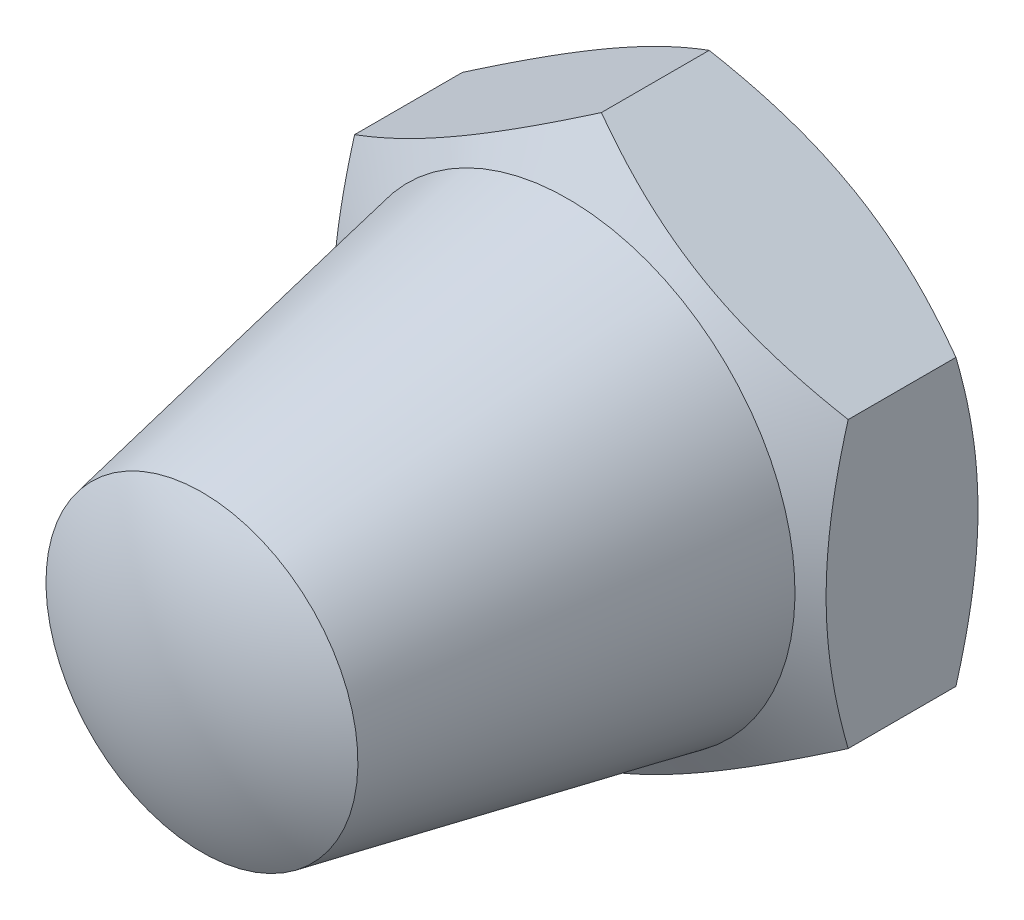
ISO-10303-21;
HEADER;
FILE_DESCRIPTION(('STEP AP214'),'2;1');
FILE_NAME('part.step','',(''),(''),'','','');
FILE_SCHEMA(('AUTOMOTIVE_DESIGN { 1 0 10303 214 1 1 1 1 }'));
ENDSEC;
DATA;
#1=APPLICATION_CONTEXT('core data for automotive mechanical design processes');
#2=APPLICATION_PROTOCOL_DEFINITION('international standard','automotive_design',2000,#1);
#3=PRODUCT_CONTEXT('',#1,'mechanical');
#4=PRODUCT('Part','Part','',(#3));
#5=PRODUCT_RELATED_PRODUCT_CATEGORY('part','',(#4));
#6=PRODUCT_DEFINITION_FORMATION('','',#4);
#7=PRODUCT_DEFINITION_CONTEXT('part definition',#1,'design');
#8=PRODUCT_DEFINITION('design','',#6,#7);
#9=PRODUCT_DEFINITION_SHAPE('','',#8);
#10=(LENGTH_UNIT() NAMED_UNIT(*) SI_UNIT(.MILLI.,.METRE.));
#11=(NAMED_UNIT(*) PLANE_ANGLE_UNIT() SI_UNIT($,.RADIAN.));
#12=(NAMED_UNIT(*) SI_UNIT($,.STERADIAN.) SOLID_ANGLE_UNIT());
#13=UNCERTAINTY_MEASURE_WITH_UNIT(LENGTH_MEASURE(1.E-05),#10,'distance_accuracy_value','');
#14=(GEOMETRIC_REPRESENTATION_CONTEXT(3) GLOBAL_UNCERTAINTY_ASSIGNED_CONTEXT((#13)) GLOBAL_UNIT_ASSIGNED_CONTEXT((#10,
#11,#12)) REPRESENTATION_CONTEXT('',''));
#15=CARTESIAN_POINT('',(0.,0.,0.));
#16=DIRECTION('',(0.,0.,1.));
#17=DIRECTION('',(1.,0.,0.));
#18=AXIS2_PLACEMENT_3D('',#15,#16,#17);
#19=CARTESIAN_POINT('',(0.,0.,0.));
#20=DIRECTION('',(0.,0.,1.));
#21=DIRECTION('',(-0.866025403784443,0.499999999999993,0.));
#22=AXIS2_PLACEMENT_3D('',#19,#20,#21);
#23=CONICAL_SURFACE('',#22,6.5,1.0471975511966);
#24=CARTESIAN_POINT('',(-6.5,-3.75300768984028,0.580623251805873));
#25=CARTESIAN_POINT('',(-6.5,-3.58802701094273,0.533004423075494));
#26=CARTESIAN_POINT('',(-6.5,-3.42243120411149,0.487546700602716));
#27=CARTESIAN_POINT('',(-6.5,-3.08989477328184,0.401548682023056));
#28=CARTESIAN_POINT('',(-6.5,-2.92295360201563,0.361010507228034));
#29=CARTESIAN_POINT('',(-6.5,-2.41945714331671,0.247571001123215));
#30=CARTESIAN_POINT('',(-6.5,-2.08091438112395,0.183047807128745));
#31=CARTESIAN_POINT('',(-6.5,-1.57429129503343,0.107386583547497));
#32=CARTESIAN_POINT('',(-6.5,-1.40772471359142,0.0858328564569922));
#33=CARTESIAN_POINT('',(-6.5,-1.0738389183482,0.0496903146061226));
#34=CARTESIAN_POINT('',(-6.5,-0.90651977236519,0.0351008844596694));
#35=CARTESIAN_POINT('',(-6.5,-0.571590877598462,0.0132587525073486));
#36=CARTESIAN_POINT('',(-6.5,-0.403981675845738,0.00599772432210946));
#37=CARTESIAN_POINT('',(-6.5,-0.0686176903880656,-0.00103969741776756));
#38=CARTESIAN_POINT('',(-6.5,0.0991370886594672,-0.000816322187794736));
#39=CARTESIAN_POINT('',(-6.5,0.558731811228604,0.0100834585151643));
#40=CARTESIAN_POINT('',(-6.5,0.850421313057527,0.0283818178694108));
#41=CARTESIAN_POINT('',(-6.5,1.43186293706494,0.0864063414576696));
#42=CARTESIAN_POINT('',(-6.5,1.72161301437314,0.126152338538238));
#43=CARTESIAN_POINT('',(-6.5,2.30422480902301,0.225505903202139));
#44=CARTESIAN_POINT('',(-6.5,2.59701301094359,0.285534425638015));
#45=CARTESIAN_POINT('',(-6.5,3.17822309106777,0.421774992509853));
#46=CARTESIAN_POINT('',(-6.5,3.46665241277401,0.497955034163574));
#47=CARTESIAN_POINT('',(-6.5,3.75300768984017,0.580623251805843));
#48=B_SPLINE_CURVE_WITH_KNOTS('',3,(#24,#25,#26,#27,#28,#29,#30,#31,#32,#33,#34,#35,#36,#37,#38,
#39,#40,#41,#42,#43,#44,#45,#46,#47),.UNSPECIFIED.,.F.,.F.,(4,2,2,2,2,2,2,2,2,2,2,4),(0.,
0.515105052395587,1.03043143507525,2.06322554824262,2.56697389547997,3.07067772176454,
3.57380860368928,4.0769239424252,4.9527935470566,5.82947446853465,6.72559912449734,
7.61996451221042),.UNSPECIFIED.);
#49=CARTESIAN_POINT('',(-6.5,0.,0.));
#50=VERTEX_POINT('',#49);
#51=CARTESIAN_POINT('',(-6.5,3.7527767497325,0.580556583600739));
#52=VERTEX_POINT('',#51);
#53=EDGE_CURVE('E144',#50,#52,#48,.T.);
#54=ORIENTED_EDGE('',*,*,#53,.T.);
#55=CARTESIAN_POINT('',(-6.5002,3.75266127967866,0.580623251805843));
#56=CARTESIAN_POINT('',(-6.35732254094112,3.83515161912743,0.533004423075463));
#57=CARTESIAN_POINT('',(-6.21391236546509,3.91794952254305,0.487546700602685));
#58=CARTESIAN_POINT('',(-5.92592736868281,4.08421773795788,0.401548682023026));
#59=CARTESIAN_POINT('',(-5.78135207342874,4.16768832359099,0.361010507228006));
#60=CARTESIAN_POINT('',(-5.34531134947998,4.41943655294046,0.247571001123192));
#61=CARTESIAN_POINT('',(-5.05212471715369,4.58870793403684,0.183047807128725));
#62=CARTESIAN_POINT('',(-4.61337625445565,4.8420194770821,0.10738658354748));
#63=CARTESIAN_POINT('',(-4.46912536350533,4.92530276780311,0.0858328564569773));
#64=CARTESIAN_POINT('',(-4.17997178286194,5.09224566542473,0.0496903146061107));
#65=CARTESIAN_POINT('',(-4.03506915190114,5.17590523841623,0.0351008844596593));
#66=CARTESIAN_POINT('',(-3.74501222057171,5.3433696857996,0.013258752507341));
#67=CARTESIAN_POINT('',(-3.59985839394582,5.42717428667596,0.00599772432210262));
#68=CARTESIAN_POINT('',(-3.30942466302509,5.59485627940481,-0.00103969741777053));
#69=CARTESIAN_POINT('',(-3.16414476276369,5.67873366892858,-0.000816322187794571));
#70=CARTESIAN_POINT('',(-2.76612405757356,5.90853103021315,0.0100834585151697));
#71=CARTESIAN_POINT('',(-2.51351353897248,6.05437578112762,0.028381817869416));
#72=CARTESIAN_POINT('',(-2.00997032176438,6.34509659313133,0.0864063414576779));
#73=CARTESIAN_POINT('',(-1.75903939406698,6.48997163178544,0.126152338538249));
#74=CARTESIAN_POINT('',(-1.25448277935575,6.78127752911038,0.225505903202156));
#75=CARTESIAN_POINT('',(-1.00092075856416,6.92767163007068,0.285534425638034));
#76=CARTESIAN_POINT('',(-0.497578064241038,7.21827667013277,0.421774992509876));
#77=CARTESIAN_POINT('',(-0.247790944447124,7.3624913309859,0.4979550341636));
#78=CARTESIAN_POINT('',(0.00019999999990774,7.50566896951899,0.580623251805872));
#79=B_SPLINE_CURVE_WITH_KNOTS('',3,(#55,#56,#57,#58,#59,#60,#61,#62,#63,#64,#65,#66,#67,#68,#69,
#70,#71,#72,#73,#74,#75,#76,#77,#78),.UNSPECIFIED.,.F.,.F.,(4,2,2,2,2,2,2,2,2,2,2,4),(0.,
0.515105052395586,1.03043143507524,2.06322554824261,2.56697389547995,3.07067772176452,
3.57380860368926,4.07692394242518,4.95279354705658,5.82947446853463,6.72559912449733,
7.61996451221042),.UNSPECIFIED.);
#80=CARTESIAN_POINT('',(-3.25000000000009,5.6291651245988,0.));
#81=VERTEX_POINT('',#80);
#82=EDGE_CURVE('E96',#52,#81,#79,.T.);
#83=ORIENTED_EDGE('',*,*,#82,.T.);
#84=CARTESIAN_POINT('',(0.,0.,0.));
#85=DIRECTION('',(0.,0.,-1.));
#86=DIRECTION('',(0.866025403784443,-0.499999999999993,0.));
#87=AXIS2_PLACEMENT_3D('',#84,#85,#86);
#88=CIRCLE('',#87,6.5);
#89=EDGE_CURVE('E271',#50,#81,#88,.T.);
#90=ORIENTED_EDGE('',*,*,#89,.F.);
#91=EDGE_LOOP('',(#54,#83,#90));
#92=FACE_BOUND('',#91,.T.);
#93=ADVANCED_FACE('F14',(#92),#23,.T.);
#94=CARTESIAN_POINT('',(3.24999999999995,5.62916512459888,0.));
#95=VERTEX_POINT('',#94);
#96=EDGE_CURVE('E272',#81,#95,#88,.T.);
#97=ORIENTED_EDGE('',*,*,#96,.F.);
#98=CARTESIAN_POINT('',(0.,7.50555349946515,0.580556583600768));
#99=VERTEX_POINT('',#98);
#100=EDGE_CURVE('E110',#81,#99,#79,.T.);
#101=ORIENTED_EDGE('',*,*,#100,.T.);
#102=CARTESIAN_POINT('',(-5.54115218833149,10.7047392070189,3.20652898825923));
#103=CARTESIAN_POINT('',(-5.29477516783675,10.5624933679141,3.06824212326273));
#104=CARTESIAN_POINT('',(-5.04783912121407,10.4199247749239,2.93126086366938));
#105=CARTESIAN_POINT('',(-4.55255194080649,10.1339705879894,2.66064242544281));
#106=CARTESIAN_POINT('',(-4.30420059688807,9.99058487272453,2.5270057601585));
#107=CARTESIAN_POINT('',(-3.80453528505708,9.70210297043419,2.26315208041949));
#108=CARTESIAN_POINT('',(-3.55321258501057,9.55700174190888,2.13295703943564));
#109=CARTESIAN_POINT('',(-3.04858964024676,9.26565754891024,1.8778010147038));
#110=CARTESIAN_POINT('',(-2.79528948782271,9.11941463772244,1.75283978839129));
#111=CARTESIAN_POINT('',(-2.27788742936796,8.82069241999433,1.50550497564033));
#112=CARTESIAN_POINT('',(-2.01370538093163,8.66816684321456,1.38335372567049));
#113=CARTESIAN_POINT('',(-1.48227292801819,8.36134417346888,1.14812603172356));
#114=CARTESIAN_POINT('',(-1.21502218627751,8.20704688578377,1.03505059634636));
#115=CARTESIAN_POINT('',(-0.677508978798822,7.89671349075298,0.820891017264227));
#116=CARTESIAN_POINT('',(-0.407253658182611,7.74068150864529,0.71978319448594));
#117=CARTESIAN_POINT('',(0.137136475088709,7.42637771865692,0.532757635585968));
#118=CARTESIAN_POINT('',(0.41127005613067,7.26810662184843,0.446835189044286));
#119=CARTESIAN_POINT('',(0.962017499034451,6.95013243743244,0.294716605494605));
#120=CARTESIAN_POINT('',(1.23860819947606,6.79044272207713,0.228410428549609));
#121=CARTESIAN_POINT('',(1.79533222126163,6.46901795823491,0.119232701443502));
#122=CARTESIAN_POINT('',(2.075465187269,6.30728311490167,0.0763588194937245));
#123=CARTESIAN_POINT('',(2.49534082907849,6.0648678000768,0.03246601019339));
#124=CARTESIAN_POINT('',(2.63431772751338,5.98462945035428,0.0212465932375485));
#125=CARTESIAN_POINT('',(2.91256414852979,5.82398380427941,0.00560203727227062));
#126=CARTESIAN_POINT('',(3.05183366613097,5.74357651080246,0.00117678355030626));
#127=CARTESIAN_POINT('',(3.33040824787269,5.58274140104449,-0.000766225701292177));
#128=CARTESIAN_POINT('',(3.46971331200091,5.50231358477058,0.00171601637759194));
#129=CARTESIAN_POINT('',(3.74810781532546,5.34158244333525,0.0135243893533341));
#130=CARTESIAN_POINT('',(3.8871972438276,5.26127912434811,0.0228508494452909));
#131=CARTESIAN_POINT('',(4.21963736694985,5.06934472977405,0.0531229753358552));
#132=CARTESIAN_POINT('',(4.41277894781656,4.95783438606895,0.0771985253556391));
#133=CARTESIAN_POINT('',(4.79765951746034,4.73562348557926,0.137250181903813));
#134=CARTESIAN_POINT('',(4.98939831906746,4.62492303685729,0.17322784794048));
#135=CARTESIAN_POINT('',(5.56227463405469,4.29417274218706,0.297109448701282));
#136=CARTESIAN_POINT('',(5.94086491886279,4.07559353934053,0.400940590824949));
#137=CARTESIAN_POINT('',(6.50702481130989,3.74872097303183,0.581447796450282));
#138=CARTESIAN_POINT('',(6.6975208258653,3.63873804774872,0.646593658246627));
#139=CARTESIAN_POINT('',(7.07666370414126,3.41983980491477,0.783766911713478));
#140=CARTESIAN_POINT('',(7.26531055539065,3.31092449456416,0.855794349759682));
#141=CARTESIAN_POINT('',(7.64081231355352,3.09412845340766,1.00556559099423));
#142=CARTESIAN_POINT('',(7.82766776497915,2.98624740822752,1.08330759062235));
#143=CARTESIAN_POINT('',(8.19982403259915,2.77138288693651,1.24358180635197));
#144=CARTESIAN_POINT('',(8.38512486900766,2.66439939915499,1.32611396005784));
#145=CARTESIAN_POINT('',(8.82994392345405,2.4075829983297,1.52979204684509));
#146=CARTESIAN_POINT('',(9.08878329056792,2.25814202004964,1.65291133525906));
#147=CARTESIAN_POINT('',(9.60418751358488,1.96057325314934,1.90536084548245));
#148=CARTESIAN_POINT('',(9.86075221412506,1.81244555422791,2.03469148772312));
#149=CARTESIAN_POINT('',(10.3720363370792,1.51725552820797,2.29828873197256));
#150=CARTESIAN_POINT('',(10.6267553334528,1.37019344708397,2.43255643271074));
#151=CARTESIAN_POINT('',(11.1346169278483,1.07697941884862,2.70501702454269));
#152=CARTESIAN_POINT('',(11.387759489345,0.930827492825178,2.84321000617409));
#153=CARTESIAN_POINT('',(11.8930170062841,0.639116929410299,3.12292631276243));
#154=CARTESIAN_POINT('',(12.1451304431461,0.493559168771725,3.26445328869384));
#155=CARTESIAN_POINT('',(12.6482508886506,0.203082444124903,3.55010805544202));
#156=CARTESIAN_POINT('',(12.8992578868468,0.0581634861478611,3.69423587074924));
#157=CARTESIAN_POINT('',(13.6508155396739,-0.375748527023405,4.12977253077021));
#158=CARTESIAN_POINT('',(14.1499773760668,-0.66393974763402,4.42437620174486));
#159=CARTESIAN_POINT('',(15.1023905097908,-1.21381572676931,4.99368726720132));
#160=CARTESIAN_POINT('',(15.5558642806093,-1.4756289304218,5.26790069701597));
#161=CARTESIAN_POINT('',(16.4611277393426,-1.99828303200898,5.82005580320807));
#162=CARTESIAN_POINT('',(16.9129173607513,-2.25912389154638,6.09799762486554));
#163=CARTESIAN_POINT('',(17.813986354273,-2.77935631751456,6.65596618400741));
#164=CARTESIAN_POINT('',(18.2632692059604,-3.03874989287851,6.93598544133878));
#165=CARTESIAN_POINT('',(19.1607624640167,-3.55691786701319,7.49823452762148));
#166=CARTESIAN_POINT('',(19.6089729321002,-3.81569230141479,7.78046422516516));
#167=CARTESIAN_POINT('',(20.0567911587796,-4.0742402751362,8.06351575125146));
#168=B_SPLINE_CURVE_WITH_KNOTS('',3,(#102,#103,#104,#105,#106,#107,#108,#109,#110,#111,#112,
#113,#114,#115,#116,#117,#118,#119,#120,#121,#122,#123,#124,#125,#126,#127,#128,#129,#130,#131,
#132,#133,#134,#135,#136,#137,#138,#139,#140,#141,#142,#143,#144,#145,#146,#147,#148,#149,#150,
#151,#152,#153,#154,#155,#156,#157,#158,#159,#160,#161,#162,#163,#164,#165,#166,#167),
.UNSPECIFIED.,.F.,.F.,(4,2,2,2,2,2,2,2,2,2,2,2,2,2,2,2,2,2,2,2,2,2,2,2,2,2,2,2,2,2,2,2,4),(0.,
0.948973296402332,1.89809136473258,2.85225848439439,3.80638133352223,4.79206603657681,
5.77786012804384,6.76166991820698,7.74517399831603,8.72305155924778,9.70083179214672,
10.1833150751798,10.6657902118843,11.1482651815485,11.6307633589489,12.3033341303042,
12.9759930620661,14.3220280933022,15.0101990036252,15.6983745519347,16.3863338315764,
17.0742841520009,18.043929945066,19.0136414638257,19.9835701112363,20.9535211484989,
21.9245888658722,22.8956657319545,24.8375327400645,26.6107620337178,28.3840606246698,
30.1526583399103,31.9211517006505),.UNSPECIFIED.);
#169=EDGE_CURVE('E182',#99,#95,#168,.T.);
#170=ORIENTED_EDGE('',*,*,#169,.T.);
#171=EDGE_LOOP('',(#97,#101,#170));
#172=FACE_BOUND('',#171,.T.);
#173=ADVANCED_FACE('F139',(#172),#23,.T.);
#174=CARTESIAN_POINT('',(6.5,0.,0.));
#175=VERTEX_POINT('',#174);
#176=EDGE_CURVE('E107',#95,#175,#88,.T.);
#177=ORIENTED_EDGE('',*,*,#176,.F.);
#178=CARTESIAN_POINT('',(6.5,3.7527767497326,0.580556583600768));
#179=VERTEX_POINT('',#178);
#180=EDGE_CURVE('E175',#95,#179,#168,.T.);
#181=ORIENTED_EDGE('',*,*,#180,.T.);
#182=CARTESIAN_POINT('',(6.5,3.75300768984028,0.580623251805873));
#183=CARTESIAN_POINT('',(6.5,3.58802701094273,0.533004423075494));
#184=CARTESIAN_POINT('',(6.5,3.42243120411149,0.487546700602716));
#185=CARTESIAN_POINT('',(6.5,3.08989477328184,0.401548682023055));
#186=CARTESIAN_POINT('',(6.5,2.92295360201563,0.361010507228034));
#187=CARTESIAN_POINT('',(6.5,2.41945714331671,0.247571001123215));
#188=CARTESIAN_POINT('',(6.5,2.08091438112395,0.183047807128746));
#189=CARTESIAN_POINT('',(6.5,1.57429129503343,0.107386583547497));
#190=CARTESIAN_POINT('',(6.5,1.40772471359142,0.085832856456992));
#191=CARTESIAN_POINT('',(6.5,1.0738389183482,0.0496903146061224));
#192=CARTESIAN_POINT('',(6.5,0.90651977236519,0.0351008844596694));
#193=CARTESIAN_POINT('',(6.5,0.571590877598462,0.0132587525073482));
#194=CARTESIAN_POINT('',(6.5,0.403981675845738,0.00599772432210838));
#195=CARTESIAN_POINT('',(6.5,0.0686176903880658,-0.00103969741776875));
#196=CARTESIAN_POINT('',(6.5,-0.0991370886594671,-0.000816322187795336));
#197=CARTESIAN_POINT('',(6.5,-0.558731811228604,0.0100834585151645));
#198=CARTESIAN_POINT('',(6.5,-0.850421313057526,0.0283818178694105));
#199=CARTESIAN_POINT('',(6.5,-1.43186293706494,0.086406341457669));
#200=CARTESIAN_POINT('',(6.5,-1.72161301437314,0.126152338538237));
#201=CARTESIAN_POINT('',(6.5,-2.30422480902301,0.225505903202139));
#202=CARTESIAN_POINT('',(6.5,-2.59701301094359,0.285534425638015));
#203=CARTESIAN_POINT('',(6.5,-3.17822309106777,0.421774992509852));
#204=CARTESIAN_POINT('',(6.5,-3.46665241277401,0.497955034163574));
#205=CARTESIAN_POINT('',(6.5,-3.75300768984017,0.580623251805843));
#206=B_SPLINE_CURVE_WITH_KNOTS('',3,(#182,#183,#184,#185,#186,#187,#188,#189,#190,#191,#192,
#193,#194,#195,#196,#197,#198,#199,#200,#201,#202,#203,#204,#205),.UNSPECIFIED.,.F.,.F.,(4,2,2,
2,2,2,2,2,2,2,2,4),(0.,0.515105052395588,1.03043143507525,2.06322554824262,2.56697389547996,
3.07067772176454,3.57380860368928,4.0769239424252,4.9527935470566,5.82947446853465,
6.72559912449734,7.61996451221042),.UNSPECIFIED.);
#207=EDGE_CURVE('E219',#179,#175,#206,.T.);
#208=ORIENTED_EDGE('',*,*,#207,.T.);
#209=EDGE_LOOP('',(#177,#181,#208));
#210=FACE_BOUND('',#209,.T.);
#211=ADVANCED_FACE('F278',(#210),#23,.T.);
#212=CARTESIAN_POINT('',(3.2500000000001,-5.6291651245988,0.));
#213=VERTEX_POINT('',#212);
#214=EDGE_CURVE('E104',#175,#213,#88,.T.);
#215=ORIENTED_EDGE('',*,*,#214,.F.);
#216=CARTESIAN_POINT('',(6.5,-3.7527767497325,0.580556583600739));
#217=VERTEX_POINT('',#216);
#218=EDGE_CURVE('E167',#175,#217,#206,.T.);
#219=ORIENTED_EDGE('',*,*,#218,.T.);
#220=CARTESIAN_POINT('',(6.5002,-3.75266127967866,0.580623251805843));
#221=CARTESIAN_POINT('',(6.35732254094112,-3.83515161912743,0.533004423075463));
#222=CARTESIAN_POINT('',(6.21391236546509,-3.91794952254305,0.487546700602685));
#223=CARTESIAN_POINT('',(5.92592736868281,-4.08421773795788,0.401548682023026));
#224=CARTESIAN_POINT('',(5.78135207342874,-4.16768832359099,0.361010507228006));
#225=CARTESIAN_POINT('',(5.34531134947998,-4.41943655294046,0.247571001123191));
#226=CARTESIAN_POINT('',(5.05212471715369,-4.58870793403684,0.183047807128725));
#227=CARTESIAN_POINT('',(4.61337625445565,-4.8420194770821,0.10738658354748));
#228=CARTESIAN_POINT('',(4.46912536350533,-4.92530276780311,0.0858328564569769));
#229=CARTESIAN_POINT('',(4.17997178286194,-5.09224566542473,0.0496903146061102));
#230=CARTESIAN_POINT('',(4.03506915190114,-5.17590523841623,0.0351008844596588));
#231=CARTESIAN_POINT('',(3.74501222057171,-5.3433696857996,0.0132587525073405));
#232=CARTESIAN_POINT('',(3.59985839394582,-5.42717428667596,0.00599772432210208));
#233=CARTESIAN_POINT('',(3.30942466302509,-5.59485627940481,-0.00103969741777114));
#234=CARTESIAN_POINT('',(3.16414476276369,-5.67873366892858,-0.000816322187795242));
#235=CARTESIAN_POINT('',(2.76612405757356,-5.90853103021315,0.0100834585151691));
#236=CARTESIAN_POINT('',(2.51351353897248,-6.05437578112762,0.0283818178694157));
#237=CARTESIAN_POINT('',(2.00997032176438,-6.34509659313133,0.0864063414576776));
#238=CARTESIAN_POINT('',(1.75903939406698,-6.48997163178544,0.126152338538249));
#239=CARTESIAN_POINT('',(1.25448277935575,-6.78127752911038,0.225505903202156));
#240=CARTESIAN_POINT('',(1.00092075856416,-6.92767163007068,0.285534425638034));
#241=CARTESIAN_POINT('',(0.497578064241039,-7.21827667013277,0.421774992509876));
#242=CARTESIAN_POINT('',(0.247790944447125,-7.3624913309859,0.4979550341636));
#243=CARTESIAN_POINT('',(-0.00019999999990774,-7.50566896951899,0.580623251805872));
#244=B_SPLINE_CURVE_WITH_KNOTS('',3,(#220,#221,#222,#223,#224,#225,#226,#227,#228,#229,#230,
#231,#232,#233,#234,#235,#236,#237,#238,#239,#240,#241,#242,#243),.UNSPECIFIED.,.F.,.F.,(4,2,2,
2,2,2,2,2,2,2,2,4),(0.,0.515105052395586,1.03043143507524,2.06322554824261,2.56697389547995,
3.07067772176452,3.57380860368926,4.07692394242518,4.95279354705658,5.82947446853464,
6.72559912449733,7.61996451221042),.UNSPECIFIED.);
#245=EDGE_CURVE('E217',#217,#213,#244,.T.);
#246=ORIENTED_EDGE('',*,*,#245,.T.);
#247=EDGE_LOOP('',(#215,#219,#246));
#248=FACE_BOUND('',#247,.T.);
#249=ADVANCED_FACE('F280',(#248),#23,.T.);
#250=CARTESIAN_POINT('',(-3.24999999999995,-5.62916512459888,0.));
#251=VERTEX_POINT('',#250);
#252=EDGE_CURVE('E109',#213,#251,#88,.T.);
#253=ORIENTED_EDGE('',*,*,#252,.F.);
#254=CARTESIAN_POINT('',(0.,-7.50555349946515,0.580556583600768));
#255=VERTEX_POINT('',#254);
#256=EDGE_CURVE('E159',#213,#255,#244,.T.);
#257=ORIENTED_EDGE('',*,*,#256,.T.);
#258=CARTESIAN_POINT('',(-12.0411521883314,-0.553591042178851,3.20652898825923));
#259=CARTESIAN_POINT('',(-11.7947751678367,-0.695836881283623,3.06824212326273));
#260=CARTESIAN_POINT('',(-11.547839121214,-0.838405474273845,2.93126086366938));
#261=CARTESIAN_POINT('',(-11.0525519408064,-1.12435966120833,2.66064242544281));
#262=CARTESIAN_POINT('',(-10.804200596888,-1.26774537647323,2.5270057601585));
#263=CARTESIAN_POINT('',(-10.304535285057,-1.55622727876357,2.26315208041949));
#264=CARTESIAN_POINT('',(-10.0532125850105,-1.70132850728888,2.13295703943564));
#265=CARTESIAN_POINT('',(-9.54858964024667,-1.99267270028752,1.8778010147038));
#266=CARTESIAN_POINT('',(-9.29528948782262,-2.13891561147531,1.75283978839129));
#267=CARTESIAN_POINT('',(-8.77788742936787,-2.43763782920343,1.50550497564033));
#268=CARTESIAN_POINT('',(-8.51370538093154,-2.5901634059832,1.38335372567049));
#269=CARTESIAN_POINT('',(-7.9822729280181,-2.89698607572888,1.14812603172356));
#270=CARTESIAN_POINT('',(-7.71502218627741,-3.05128336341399,1.03505059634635));
#271=CARTESIAN_POINT('',(-7.17750897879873,-3.36161675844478,0.820891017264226));
#272=CARTESIAN_POINT('',(-6.90725365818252,-3.51764874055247,0.719783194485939));
#273=CARTESIAN_POINT('',(-6.3628635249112,-3.83195253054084,0.532757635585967));
#274=CARTESIAN_POINT('',(-6.08872994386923,-3.99022362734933,0.446835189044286));
#275=CARTESIAN_POINT('',(-5.53798250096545,-4.30819781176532,0.294716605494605));
#276=CARTESIAN_POINT('',(-5.26139180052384,-4.46788752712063,0.228410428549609));
#277=CARTESIAN_POINT('',(-4.70466777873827,-4.78931229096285,0.119232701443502));
#278=CARTESIAN_POINT('',(-4.42453481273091,-4.95104713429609,0.0763588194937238));
#279=CARTESIAN_POINT('',(-4.00465917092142,-5.19346244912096,0.0324660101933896));
#280=CARTESIAN_POINT('',(-3.86568227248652,-5.27370079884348,0.0212465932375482));
#281=CARTESIAN_POINT('',(-3.58743585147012,-5.43434644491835,0.00560203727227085));
#282=CARTESIAN_POINT('',(-3.44816633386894,-5.5147537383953,0.0011767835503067));
#283=CARTESIAN_POINT('',(-3.16959175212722,-5.67558884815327,-0.000766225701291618));
#284=CARTESIAN_POINT('',(-3.030286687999,-5.75601666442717,0.0017160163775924));
#285=CARTESIAN_POINT('',(-2.75189218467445,-5.91674780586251,0.0135243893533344));
#286=CARTESIAN_POINT('',(-2.61280275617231,-5.99705112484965,0.0228508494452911));
#287=CARTESIAN_POINT('',(-2.28036263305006,-6.18898551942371,0.0531229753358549));
#288=CARTESIAN_POINT('',(-2.08722105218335,-6.30049586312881,0.0771985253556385));
#289=CARTESIAN_POINT('',(-1.70234048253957,-6.5227067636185,0.137250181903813));
#290=CARTESIAN_POINT('',(-1.51060168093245,-6.63340721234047,0.17322784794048));
#291=CARTESIAN_POINT('',(-0.937725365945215,-6.9641575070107,0.297109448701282));
#292=CARTESIAN_POINT('',(-0.559135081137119,-7.18273670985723,0.400940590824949));
#293=CARTESIAN_POINT('',(0.00702481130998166,-7.50960927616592,0.581447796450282));
#294=CARTESIAN_POINT('',(0.197520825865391,-7.61959220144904,0.646593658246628));
#295=CARTESIAN_POINT('',(0.576663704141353,-7.83849044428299,0.783766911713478));
#296=CARTESIAN_POINT('',(0.765310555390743,-7.9474057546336,0.855794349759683));
#297=CARTESIAN_POINT('',(1.14081231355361,-8.1642017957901,1.00556559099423));
#298=CARTESIAN_POINT('',(1.32766776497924,-8.27208284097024,1.08330759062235));
#299=CARTESIAN_POINT('',(1.69982403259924,-8.48694736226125,1.24358180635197));
#300=CARTESIAN_POINT('',(1.88512486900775,-8.59393085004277,1.32611396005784));
#301=CARTESIAN_POINT('',(2.32994392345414,-8.85074725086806,1.52979204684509));
#302=CARTESIAN_POINT('',(2.58878329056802,-9.00018822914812,1.65291133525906));
#303=CARTESIAN_POINT('',(3.10418751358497,-9.29775699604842,1.90536084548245));
#304=CARTESIAN_POINT('',(3.36075221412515,-9.44588469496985,2.03469148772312));
#305=CARTESIAN_POINT('',(3.87203633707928,-9.74107472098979,2.29828873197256));
#306=CARTESIAN_POINT('',(4.12675533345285,-9.88813680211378,2.43255643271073));
#307=CARTESIAN_POINT('',(4.63461692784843,-10.1813508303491,2.70501702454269));
#308=CARTESIAN_POINT('',(4.88775948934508,-10.3275027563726,2.84321000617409));
#309=CARTESIAN_POINT('',(5.3930170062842,-10.6192133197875,3.12292631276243));
#310=CARTESIAN_POINT('',(5.64513044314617,-10.764771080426,3.26445328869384));
#311=CARTESIAN_POINT('',(6.14825088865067,-11.0552478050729,3.55010805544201));
#312=CARTESIAN_POINT('',(6.39925788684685,-11.2001667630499,3.69423587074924));
#313=CARTESIAN_POINT('',(7.15081553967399,-11.6340787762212,4.1297725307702));
#314=CARTESIAN_POINT('',(7.64997737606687,-11.9222699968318,4.42437620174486));
#315=CARTESIAN_POINT('',(8.6023905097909,-12.4721459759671,4.99368726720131));
#316=CARTESIAN_POINT('',(9.05586428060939,-12.7339591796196,5.26790069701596));
#317=CARTESIAN_POINT('',(9.96112773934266,-13.2566132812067,5.82005580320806));
#318=CARTESIAN_POINT('',(10.4129173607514,-13.5174541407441,6.09799762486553));
#319=CARTESIAN_POINT('',(11.3139863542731,-14.0376865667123,6.65596618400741));
#320=CARTESIAN_POINT('',(11.7632692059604,-14.2970801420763,6.93598544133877));
#321=CARTESIAN_POINT('',(12.6607624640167,-14.8152481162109,7.49823452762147));
#322=CARTESIAN_POINT('',(13.1089729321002,-15.0740225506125,7.78046422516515));
#323=CARTESIAN_POINT('',(13.5567911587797,-15.3325705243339,8.06351575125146));
#324=B_SPLINE_CURVE_WITH_KNOTS('',3,(#258,#259,#260,#261,#262,#263,#264,#265,#266,#267,#268,
#269,#270,#271,#272,#273,#274,#275,#276,#277,#278,#279,#280,#281,#282,#283,#284,#285,#286,#287,
#288,#289,#290,#291,#292,#293,#294,#295,#296,#297,#298,#299,#300,#301,#302,#303,#304,#305,#306,
#307,#308,#309,#310,#311,#312,#313,#314,#315,#316,#317,#318,#319,#320,#321,#322,#323),
.UNSPECIFIED.,.F.,.F.,(4,2,2,2,2,2,2,2,2,2,2,2,2,2,2,2,2,2,2,2,2,2,2,2,2,2,2,2,2,2,2,2,4),(0.,
0.948973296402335,1.89809136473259,2.85225848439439,3.80638133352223,4.79206603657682,
5.77786012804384,6.76166991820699,7.74517399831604,8.72305155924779,9.70083179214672,
10.1833150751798,10.6657902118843,11.1482651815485,11.630763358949,12.3033341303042,
12.9759930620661,14.3220280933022,15.0101990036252,15.6983745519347,16.3863338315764,
17.0742841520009,18.0439299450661,19.0136414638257,19.9835701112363,20.9535211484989,
21.9245888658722,22.8956657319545,24.8375327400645,26.6107620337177,28.3840606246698,
30.1526583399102,31.9211517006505),.UNSPECIFIED.);
#325=EDGE_CURVE('E228',#255,#251,#324,.F.);
#326=ORIENTED_EDGE('',*,*,#325,.T.);
#327=EDGE_LOOP('',(#253,#257,#326));
#328=FACE_BOUND('',#327,.T.);
#329=ADVANCED_FACE('F293',(#328),#23,.T.);
#330=EDGE_CURVE('E239',#251,#50,#88,.T.);
#331=ORIENTED_EDGE('',*,*,#330,.F.);
#332=CARTESIAN_POINT('',(-6.5,-3.7527767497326,0.580556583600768));
#333=VERTEX_POINT('',#332);
#334=EDGE_CURVE('E87',#251,#333,#324,.F.);
#335=ORIENTED_EDGE('',*,*,#334,.T.);
#336=EDGE_CURVE('E88',#333,#50,#48,.T.);
#337=ORIENTED_EDGE('',*,*,#336,.T.);
#338=EDGE_LOOP('',(#331,#335,#337));
#339=FACE_BOUND('',#338,.T.);
#340=ADVANCED_FACE('F135',(#339),#23,.T.);
#341=CARTESIAN_POINT('',(5.62916512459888,-3.24999999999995,0.));
#342=DIRECTION('',(0.,0.,-1.));
#343=DIRECTION('',(0.866025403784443,-0.499999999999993,0.));
#344=AXIS2_PLACEMENT_3D('',#341,#342,#343);
#345=PLANE('',#344);
#346=CARTESIAN_POINT('',(0.,0.,0.));
#347=DIRECTION('',(0.,0.,-1.));
#348=DIRECTION('',(-0.866025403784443,0.499999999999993,0.));
#349=AXIS2_PLACEMENT_3D('',#346,#347,#348);
#350=CIRCLE('',#349,4.);
#351=CARTESIAN_POINT('',(-3.46410161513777,1.99999999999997,0.));
#352=VERTEX_POINT('',#351);
#353=EDGE_CURVE('E256',#352,#352,#350,.T.);
#354=ORIENTED_EDGE('',*,*,#353,.F.);
#355=EDGE_LOOP('',(#354));
#356=FACE_BOUND('',#355,.T.);
#357=ORIENTED_EDGE('',*,*,#252,.T.);
#358=ORIENTED_EDGE('',*,*,#330,.T.);
#359=ORIENTED_EDGE('',*,*,#89,.T.);
#360=ORIENTED_EDGE('',*,*,#96,.T.);
#361=ORIENTED_EDGE('',*,*,#176,.T.);
#362=ORIENTED_EDGE('',*,*,#214,.T.);
#363=EDGE_LOOP('',(#357,#358,#359,#360,#361,#362));
#364=FACE_BOUND('',#363,.T.);
#365=ADVANCED_FACE('F130',(#356,#364),#345,.T.);
#366=CARTESIAN_POINT('',(0.,7.50555349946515,-15.));
#367=DIRECTION('',(-0.500000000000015,0.866025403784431,0.));
#368=DIRECTION('',(-0.866025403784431,-0.500000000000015,0.));
#369=AXIS2_PLACEMENT_3D('',#366,#367,#368);
#370=PLANE('',#369);
#371=DIRECTION('',(0.,0.,1.));
#372=VECTOR('',#371,1.);
#373=CARTESIAN_POINT('',(0.,7.50555349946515,-15.));
#374=LINE('',#373,#372);
#375=CARTESIAN_POINT('',(0.,7.50555349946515,3.41944341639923));
#376=VERTEX_POINT('',#375);
#377=EDGE_CURVE('E254',#99,#376,#374,.T.);
#378=ORIENTED_EDGE('',*,*,#377,.F.);
#379=ORIENTED_EDGE('',*,*,#100,.F.);
#380=ORIENTED_EDGE('',*,*,#82,.F.);
#381=DIRECTION('',(0.,0.,1.));
#382=VECTOR('',#381,1.);
#383=CARTESIAN_POINT('',(-6.5,3.7527767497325,-15.));
#384=LINE('',#383,#382);
#385=CARTESIAN_POINT('',(-6.5,3.7527767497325,3.41944341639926));
#386=VERTEX_POINT('',#385);
#387=EDGE_CURVE('E35',#52,#386,#384,.T.);
#388=ORIENTED_EDGE('',*,*,#387,.T.);
#389=CARTESIAN_POINT('',(0.00019999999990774,7.50566896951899,3.41937674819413));
#390=CARTESIAN_POINT('',(-0.142677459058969,7.42317863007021,3.46699557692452));
#391=CARTESIAN_POINT('',(-0.286087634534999,7.34038072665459,3.5124532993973));
#392=CARTESIAN_POINT('',(-0.574072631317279,7.17411251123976,3.59845131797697));
#393=CARTESIAN_POINT('',(-0.718647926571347,7.09064192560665,3.63898949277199));
#394=CARTESIAN_POINT('',(-1.15468865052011,6.83889369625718,3.7524289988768));
#395=CARTESIAN_POINT('',(-1.4478752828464,6.6696223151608,3.81695219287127));
#396=CARTESIAN_POINT('',(-1.88662374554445,6.41631077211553,3.89261341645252));
#397=CARTESIAN_POINT('',(-2.03087463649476,6.33302748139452,3.91416714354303));
#398=CARTESIAN_POINT('',(-2.32002821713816,6.16608458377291,3.9503096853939));
#399=CARTESIAN_POINT('',(-2.46493084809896,6.0824250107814,3.96489911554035));
#400=CARTESIAN_POINT('',(-2.75498777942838,5.91496056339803,3.98674124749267));
#401=CARTESIAN_POINT('',(-2.90014160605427,5.83115596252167,3.99400227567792));
#402=CARTESIAN_POINT('',(-3.19057533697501,5.66347396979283,4.00103969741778));
#403=CARTESIAN_POINT('',(-3.33585523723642,5.57959658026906,4.0008163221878));
#404=CARTESIAN_POINT('',(-3.73387594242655,5.34979921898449,3.98991654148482));
#405=CARTESIAN_POINT('',(-3.98648646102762,5.20395446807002,3.9716181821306));
#406=CARTESIAN_POINT('',(-4.49002967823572,4.9132336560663,3.91359365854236));
#407=CARTESIAN_POINT('',(-4.74096060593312,4.7683586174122,3.87384766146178));
#408=CARTESIAN_POINT('',(-5.24551722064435,4.47705272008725,3.77449409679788));
#409=CARTESIAN_POINT('',(-5.49907924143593,4.33065861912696,3.714465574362));
#410=CARTESIAN_POINT('',(-6.00242193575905,4.04005357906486,3.57822500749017));
#411=CARTESIAN_POINT('',(-6.25220905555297,3.89583891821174,3.50204496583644));
#412=CARTESIAN_POINT('',(-6.5002,3.75266127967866,3.41937674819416));
#413=B_SPLINE_CURVE_WITH_KNOTS('',3,(#389,#390,#391,#392,#393,#394,#395,#396,#397,#398,#399,
#400,#401,#402,#403,#404,#405,#406,#407,#408,#409,#410,#411,#412),.UNSPECIFIED.,.F.,.F.,(4,2,2,
2,2,2,2,2,2,2,2,4),(0.,0.515105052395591,1.03043143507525,2.06322554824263,2.56697389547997,
3.07067772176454,3.57380860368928,4.07692394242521,4.9527935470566,5.82947446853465,
6.72559912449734,7.61996451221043),.UNSPECIFIED.);
#414=EDGE_CURVE('E93',#376,#386,#413,.T.);
#415=ORIENTED_EDGE('',*,*,#414,.F.);
#416=EDGE_LOOP('',(#378,#379,#380,#388,#415));
#417=FACE_BOUND('',#416,.T.);
#418=ADVANCED_FACE('F92',(#417),#370,.T.);
#419=CARTESIAN_POINT('',(6.5,3.7527767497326,-15.));
#420=DIRECTION('',(0.499999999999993,0.866025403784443,0.));
#421=DIRECTION('',(-0.866025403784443,0.499999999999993,0.));
#422=AXIS2_PLACEMENT_3D('',#419,#420,#421);
#423=PLANE('',#422);
#424=DIRECTION('',(0.,0.,1.));
#425=VECTOR('',#424,1.);
#426=CARTESIAN_POINT('',(6.5,3.7527767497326,-15.));
#427=LINE('',#426,#425);
#428=CARTESIAN_POINT('',(6.5,3.7527767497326,3.41944341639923));
#429=VERTEX_POINT('',#428);
#430=EDGE_CURVE('E251',#179,#429,#427,.T.);
#431=ORIENTED_EDGE('',*,*,#430,.F.);
#432=ORIENTED_EDGE('',*,*,#180,.F.);
#433=ORIENTED_EDGE('',*,*,#169,.F.);
#434=ORIENTED_EDGE('',*,*,#377,.T.);
#435=CARTESIAN_POINT('',(-5.50464676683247,10.6836627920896,0.813953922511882));
#436=CARTESIAN_POINT('',(-5.25856626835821,10.5415881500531,0.951906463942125));
#437=CARTESIAN_POINT('',(-5.01192350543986,10.3991888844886,1.08854446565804));
#438=CARTESIAN_POINT('',(-4.517214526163,10.1135685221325,1.35845260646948));
#439=CARTESIAN_POINT('',(-4.26914809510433,9.97034730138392,1.49172222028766));
#440=CARTESIAN_POINT('',(-3.77002670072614,9.68217942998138,1.75481910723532));
#441=CARTESIAN_POINT('',(-3.5189628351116,9.53722763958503,1.88462393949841));
#442=CARTESIAN_POINT('',(-3.01484675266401,9.2461760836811,2.13895929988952));
#443=CARTESIAN_POINT('',(-2.76179462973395,9.10007637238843,2.26349007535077));
#444=CARTESIAN_POINT('',(-2.24505569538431,8.80173700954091,2.50981565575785));
#445=CARTESIAN_POINT('',(-1.98129000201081,8.64945181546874,2.63139101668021));
#446=CARTESIAN_POINT('',(-1.45068168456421,8.34310496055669,2.86540938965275));
#447=CARTESIAN_POINT('',(-1.18383872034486,8.1890431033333,2.97785138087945));
#448=CARTESIAN_POINT('',(-0.647143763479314,7.87918212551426,3.19067263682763));
#449=CARTESIAN_POINT('',(-0.377299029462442,7.72338719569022,3.29107606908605));
#450=CARTESIAN_POINT('',(0.166264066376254,7.40956089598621,3.4766162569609));
#451=CARTESIAN_POINT('',(0.439981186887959,7.25153024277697,3.56175779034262));
#452=CARTESIAN_POINT('',(0.989916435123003,6.93402497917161,3.71225918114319));
#453=CARTESIAN_POINT('',(1.2661121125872,6.77456333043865,3.77772667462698));
#454=CARTESIAN_POINT('',(1.82200305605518,6.45361954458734,3.88518106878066));
#455=CARTESIAN_POINT('',(2.10169797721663,6.29213760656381,3.92717026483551));
#456=CARTESIAN_POINT('',(2.52089047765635,6.05011670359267,3.96975845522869));
#457=CARTESIAN_POINT('',(2.65964585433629,5.970006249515,3.98054959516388));
#458=CARTESIAN_POINT('',(2.93743366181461,5.8096253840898,3.99535095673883));
#459=CARTESIAN_POINT('',(3.07646608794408,5.72935497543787,3.99936129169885));
#460=CARTESIAN_POINT('',(3.35455197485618,5.56880201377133,4.00049782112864));
#461=CARTESIAN_POINT('',(3.4936054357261,5.48851946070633,3.99762398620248));
#462=CARTESIAN_POINT('',(3.77148360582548,5.32808642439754,3.98506477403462));
#463=CARTESIAN_POINT('',(3.91030830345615,5.2479359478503,3.97537906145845));
#464=CARTESIAN_POINT('',(4.24317824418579,5.05575339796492,3.94419318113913));
#465=CARTESIAN_POINT('',(4.43700457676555,4.94384771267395,3.91951007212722));
#466=CARTESIAN_POINT('',(4.8232260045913,4.72086266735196,3.85820420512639));
#467=CARTESIAN_POINT('',(5.01562090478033,4.60978341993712,3.8215798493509));
#468=CARTESIAN_POINT('',(5.59043287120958,4.27791557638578,3.69573612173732));
#469=CARTESIAN_POINT('',(5.97026630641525,4.05861864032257,3.59056847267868));
#470=CARTESIAN_POINT('',(6.53828857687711,3.73067082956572,3.40807580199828));
#471=CARTESIAN_POINT('',(6.72942027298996,3.6203208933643,3.34226066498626));
#472=CARTESIAN_POINT('',(7.10982731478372,3.40069278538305,3.20376518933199));
#473=CARTESIAN_POINT('',(7.29910264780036,3.29141462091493,3.13108480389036));
#474=CARTESIAN_POINT('',(7.67585644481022,3.07389571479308,2.98002751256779));
#475=CARTESIAN_POINT('',(7.86333546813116,2.96565465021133,2.90165244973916));
#476=CARTESIAN_POINT('',(8.23673796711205,2.75007061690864,2.74013098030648));
#477=CARTESIAN_POINT('',(8.42266146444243,2.64272763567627,2.65698464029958));
#478=CARTESIAN_POINT('',(8.87505986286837,2.3815352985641,2.44905554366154));
#479=CARTESIAN_POINT('',(9.14079224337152,2.22811463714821,2.3221222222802));
#480=CARTESIAN_POINT('',(9.66989077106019,1.92263945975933,2.06182235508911));
#481=CARTESIAN_POINT('',(9.93325674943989,1.77058504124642,1.92845535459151));
#482=CARTESIAN_POINT('',(10.4580868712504,1.4675742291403,1.65663156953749));
#483=CARTESIAN_POINT('',(10.7195505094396,1.31661812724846,1.51817348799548));
#484=CARTESIAN_POINT('',(11.2408413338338,1.01565072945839,1.237238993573));
#485=CARTESIAN_POINT('',(11.5006685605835,0.865639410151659,1.09476268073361));
#486=CARTESIAN_POINT('',(12.019282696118,0.566217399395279,0.806400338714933));
#487=CARTESIAN_POINT('',(12.278067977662,0.416807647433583,0.660510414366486));
#488=CARTESIAN_POINT('',(12.7945079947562,0.118640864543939,0.366083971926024));
#489=CARTESIAN_POINT('',(13.0521627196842,-0.0301161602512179,0.217547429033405));
#490=CARTESIAN_POINT('',(13.82363380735,-0.475525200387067,-0.231257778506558));
#491=CARTESIAN_POINT('',(14.3360362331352,-0.771360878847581,-0.534766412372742));
#492=CARTESIAN_POINT('',(15.3127558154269,-1.33527019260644,-1.12056744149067));
#493=CARTESIAN_POINT('',(15.7773029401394,-1.60347660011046,-1.40235093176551));
#494=CARTESIAN_POINT('',(16.7047068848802,-2.13891351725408,-1.9696523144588));
#495=CARTESIAN_POINT('',(17.1675636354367,-2.40614398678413,-2.25517035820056));
#496=CARTESIAN_POINT('',(18.0907213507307,-2.9391293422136,-2.82825869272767));
#497=CARTESIAN_POINT('',(18.5510258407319,-3.20488626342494,-3.11582142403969));
#498=CARTESIAN_POINT('',(19.470562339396,-3.73578090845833,-3.69314970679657));
#499=CARTESIAN_POINT('',(19.9297944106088,-4.00091866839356,-3.98291512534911));
#500=CARTESIAN_POINT('',(20.3886360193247,-4.26583099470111,-4.27349716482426));
#501=B_SPLINE_CURVE_WITH_KNOTS('',3,(#435,#436,#437,#438,#439,#440,#441,#442,#443,#444,#445,
#446,#447,#448,#449,#450,#451,#452,#453,#454,#455,#456,#457,#458,#459,#460,#461,#462,#463,#464,
#465,#466,#467,#468,#469,#470,#471,#472,#473,#474,#475,#476,#477,#478,#479,#480,#481,#482,#483,
#484,#485,#486,#487,#488,#489,#490,#491,#492,#493,#494,#495,#496,#497,#498,#499,#500),
.UNSPECIFIED.,.F.,.F.,(4,2,2,2,2,2,2,2,2,2,2,2,2,2,2,2,2,2,2,2,2,2,2,2,2,2,2,2,2,2,2,2,4),(0.,
0.947611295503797,1.89536946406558,2.8482389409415,3.8010636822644,4.78476621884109,
5.76857855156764,6.75038157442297,7.73187670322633,8.70790002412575,9.68382790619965,
10.165457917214,10.6470798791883,11.128703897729,11.6103516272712,12.285475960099,
12.9606906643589,14.3118504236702,15.0027050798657,15.6935644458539,16.3842012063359,
17.074828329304,18.0709060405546,19.0670542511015,20.0634580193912,21.0598370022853,
22.0574144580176,23.0550012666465,25.0498701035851,26.8676185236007,28.6854408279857,
30.4983869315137,32.3112245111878),.UNSPECIFIED.);
#502=EDGE_CURVE('E103',#429,#376,#501,.F.);
#503=ORIENTED_EDGE('',*,*,#502,.F.);
#504=EDGE_LOOP('',(#431,#432,#433,#434,#503));
#505=FACE_BOUND('',#504,.T.);
#506=ADVANCED_FACE('F129',(#505),#423,.T.);
#507=CARTESIAN_POINT('',(6.5,-3.7527767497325,-15.));
#508=DIRECTION('',(1.,0.,0.));
#509=DIRECTION('',(0.,1.,0.));
#510=AXIS2_PLACEMENT_3D('',#507,#508,#509);
#511=PLANE('',#510);
#512=DIRECTION('',(0.,0.,1.));
#513=VECTOR('',#512,1.);
#514=CARTESIAN_POINT('',(6.5,-3.7527767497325,-15.));
#515=LINE('',#514,#513);
#516=CARTESIAN_POINT('',(6.5,-3.7527767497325,3.41944341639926));
#517=VERTEX_POINT('',#516);
#518=EDGE_CURVE('E246',#217,#517,#515,.T.);
#519=ORIENTED_EDGE('',*,*,#518,.F.);
#520=ORIENTED_EDGE('',*,*,#218,.F.);
#521=ORIENTED_EDGE('',*,*,#207,.F.);
#522=ORIENTED_EDGE('',*,*,#430,.T.);
#523=CARTESIAN_POINT('',(6.5,-3.75300768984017,3.41937674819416));
#524=CARTESIAN_POINT('',(6.5,-3.58802701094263,3.46699557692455));
#525=CARTESIAN_POINT('',(6.5,-3.42243120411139,3.51245329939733));
#526=CARTESIAN_POINT('',(6.5,-3.08989477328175,3.59845131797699));
#527=CARTESIAN_POINT('',(6.5,-2.92295360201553,3.63898949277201));
#528=CARTESIAN_POINT('',(6.5,-2.41945714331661,3.75242899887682));
#529=CARTESIAN_POINT('',(6.5,-2.08091438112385,3.81695219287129));
#530=CARTESIAN_POINT('',(6.5,-1.57429129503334,3.89261341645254));
#531=CARTESIAN_POINT('',(6.5,-1.40772471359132,3.91416714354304));
#532=CARTESIAN_POINT('',(6.5,-1.07383891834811,3.95030968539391));
#533=CARTESIAN_POINT('',(6.5,-0.9065197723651,3.96489911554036));
#534=CARTESIAN_POINT('',(6.5,-0.571590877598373,3.98674124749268));
#535=CARTESIAN_POINT('',(6.5,-0.403981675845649,3.99400227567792));
#536=CARTESIAN_POINT('',(6.5,-0.0686176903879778,4.00103969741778));
#537=CARTESIAN_POINT('',(6.5,0.0991370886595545,4.0008163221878));
#538=CARTESIAN_POINT('',(6.5,0.558731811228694,3.98991654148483));
#539=CARTESIAN_POINT('',(6.5,0.850421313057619,3.9716181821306));
#540=CARTESIAN_POINT('',(6.5,1.43186293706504,3.91359365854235));
#541=CARTESIAN_POINT('',(6.5,1.72161301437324,3.87384766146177));
#542=CARTESIAN_POINT('',(6.5,2.30422480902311,3.77449409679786));
#543=CARTESIAN_POINT('',(6.5,2.59701301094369,3.71446557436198));
#544=CARTESIAN_POINT('',(6.5,3.17822309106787,3.57822500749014));
#545=CARTESIAN_POINT('',(6.5,3.46665241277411,3.50204496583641));
#546=CARTESIAN_POINT('',(6.5,3.75300768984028,3.41937674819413));
#547=B_SPLINE_CURVE_WITH_KNOTS('',3,(#523,#524,#525,#526,#527,#528,#529,#530,#531,#532,#533,
#534,#535,#536,#537,#538,#539,#540,#541,#542,#543,#544,#545,#546),.UNSPECIFIED.,.F.,.F.,(4,2,2,
2,2,2,2,2,2,2,2,4),(0.,0.515105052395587,1.03043143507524,2.06322554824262,2.56697389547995,
3.07067772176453,3.57380860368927,4.07692394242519,4.95279354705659,5.82947446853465,
6.72559912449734,7.61996451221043),.UNSPECIFIED.);
#548=EDGE_CURVE('E183',#517,#429,#547,.T.);
#549=ORIENTED_EDGE('',*,*,#548,.F.);
#550=EDGE_LOOP('',(#519,#520,#521,#522,#549));
#551=FACE_BOUND('',#550,.T.);
#552=ADVANCED_FACE('F195',(#551),#511,.T.);
#553=CARTESIAN_POINT('',(0.,-7.50555349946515,-15.));
#554=DIRECTION('',(0.500000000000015,-0.866025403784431,0.));
#555=DIRECTION('',(0.866025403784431,0.500000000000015,0.));
#556=AXIS2_PLACEMENT_3D('',#553,#554,#555);
#557=PLANE('',#556);
#558=DIRECTION('',(0.,0.,1.));
#559=VECTOR('',#558,1.);
#560=CARTESIAN_POINT('',(0.,-7.50555349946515,-15.));
#561=LINE('',#560,#559);
#562=CARTESIAN_POINT('',(0.,-7.50555349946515,3.41944341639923));
#563=VERTEX_POINT('',#562);
#564=EDGE_CURVE('E244',#255,#563,#561,.T.);
#565=ORIENTED_EDGE('',*,*,#564,.F.);
#566=ORIENTED_EDGE('',*,*,#256,.F.);
#567=ORIENTED_EDGE('',*,*,#245,.F.);
#568=ORIENTED_EDGE('',*,*,#518,.T.);
#569=CARTESIAN_POINT('',(-0.00019999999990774,-7.50566896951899,3.41937674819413));
#570=CARTESIAN_POINT('',(0.142677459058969,-7.42317863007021,3.46699557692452));
#571=CARTESIAN_POINT('',(0.286087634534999,-7.34038072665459,3.5124532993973));
#572=CARTESIAN_POINT('',(0.574072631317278,-7.17411251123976,3.59845131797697));
#573=CARTESIAN_POINT('',(0.718647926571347,-7.09064192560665,3.63898949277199));
#574=CARTESIAN_POINT('',(1.15468865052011,-6.83889369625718,3.7524289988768));
#575=CARTESIAN_POINT('',(1.44787528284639,-6.6696223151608,3.81695219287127));
#576=CARTESIAN_POINT('',(1.88662374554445,-6.41631077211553,3.89261341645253));
#577=CARTESIAN_POINT('',(2.03087463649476,-6.33302748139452,3.91416714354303));
#578=CARTESIAN_POINT('',(2.32002821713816,-6.16608458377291,3.9503096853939));
#579=CARTESIAN_POINT('',(2.46493084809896,-6.0824250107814,3.96489911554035));
#580=CARTESIAN_POINT('',(2.75498777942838,-5.91496056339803,3.98674124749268));
#581=CARTESIAN_POINT('',(2.90014160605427,-5.83115596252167,3.99400227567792));
#582=CARTESIAN_POINT('',(3.19057533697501,-5.66347396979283,4.00103969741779));
#583=CARTESIAN_POINT('',(3.33585523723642,-5.57959658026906,4.0008163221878));
#584=CARTESIAN_POINT('',(3.73387594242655,-5.34979921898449,3.98991654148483));
#585=CARTESIAN_POINT('',(3.98648646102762,-5.20395446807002,3.9716181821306));
#586=CARTESIAN_POINT('',(4.49002967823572,-4.9132336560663,3.91359365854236));
#587=CARTESIAN_POINT('',(4.74096060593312,-4.7683586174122,3.87384766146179));
#588=CARTESIAN_POINT('',(5.24551722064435,-4.47705272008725,3.77449409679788));
#589=CARTESIAN_POINT('',(5.49907924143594,-4.33065861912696,3.71446557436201));
#590=CARTESIAN_POINT('',(6.00242193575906,-4.04005357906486,3.57822500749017));
#591=CARTESIAN_POINT('',(6.25220905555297,-3.89583891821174,3.50204496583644));
#592=CARTESIAN_POINT('',(6.5002,-3.75266127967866,3.41937674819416));
#593=B_SPLINE_CURVE_WITH_KNOTS('',3,(#569,#570,#571,#572,#573,#574,#575,#576,#577,#578,#579,
#580,#581,#582,#583,#584,#585,#586,#587,#588,#589,#590,#591,#592),.UNSPECIFIED.,.F.,.F.,(4,2,2,
2,2,2,2,2,2,2,2,4),(0.,0.515105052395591,1.03043143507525,2.06322554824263,2.56697389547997,
3.07067772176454,3.57380860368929,4.07692394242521,4.9527935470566,5.82947446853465,
6.72559912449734,7.61996451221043),.UNSPECIFIED.);
#594=EDGE_CURVE('E211',#563,#517,#593,.T.);
#595=ORIENTED_EDGE('',*,*,#594,.F.);
#596=EDGE_LOOP('',(#565,#566,#567,#568,#595));
#597=FACE_BOUND('',#596,.T.);
#598=ADVANCED_FACE('F202',(#597),#557,.T.);
#599=CARTESIAN_POINT('',(-6.5,-3.7527767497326,-15.));
#600=DIRECTION('',(-0.499999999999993,-0.866025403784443,0.));
#601=DIRECTION('',(0.866025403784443,-0.499999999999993,0.));
#602=AXIS2_PLACEMENT_3D('',#599,#600,#601);
#603=PLANE('',#602);
#604=DIRECTION('',(0.,0.,1.));
#605=VECTOR('',#604,1.);
#606=CARTESIAN_POINT('',(-6.5,-3.7527767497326,-15.));
#607=LINE('',#606,#605);
#608=CARTESIAN_POINT('',(-6.5,-3.7527767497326,3.41944341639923));
#609=VERTEX_POINT('',#608);
#610=EDGE_CURVE('E29',#333,#609,#607,.T.);
#611=ORIENTED_EDGE('',*,*,#610,.F.);
#612=ORIENTED_EDGE('',*,*,#334,.F.);
#613=ORIENTED_EDGE('',*,*,#325,.F.);
#614=ORIENTED_EDGE('',*,*,#564,.T.);
#615=CARTESIAN_POINT('',(-12.0046467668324,-0.57466745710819,0.813953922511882));
#616=CARTESIAN_POINT('',(-11.7585662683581,-0.716742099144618,0.951906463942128));
#617=CARTESIAN_POINT('',(-11.5119235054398,-0.859141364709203,1.08854446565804));
#618=CARTESIAN_POINT('',(-11.0172145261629,-1.14476172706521,1.35845260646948));
#619=CARTESIAN_POINT('',(-10.7691480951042,-1.28798294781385,1.49172222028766));
#620=CARTESIAN_POINT('',(-10.270026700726,-1.57615081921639,1.75481910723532));
#621=CARTESIAN_POINT('',(-10.0189628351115,-1.72110260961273,1.88462393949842));
#622=CARTESIAN_POINT('',(-9.51484675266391,-2.01215416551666,2.13895929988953));
#623=CARTESIAN_POINT('',(-9.26179462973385,-2.15825387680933,2.26349007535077));
#624=CARTESIAN_POINT('',(-8.74505569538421,-2.45659323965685,2.50981565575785));
#625=CARTESIAN_POINT('',(-8.48129000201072,-2.60887843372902,2.63139101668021));
#626=CARTESIAN_POINT('',(-7.95068168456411,-2.91522528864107,2.86540938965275));
#627=CARTESIAN_POINT('',(-7.68383872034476,-3.06928714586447,2.97785138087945));
#628=CARTESIAN_POINT('',(-7.14714376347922,-3.3791481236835,3.19067263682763));
#629=CARTESIAN_POINT('',(-6.87729902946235,-3.53494305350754,3.29107606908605));
#630=CARTESIAN_POINT('',(-6.33373593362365,-3.84876935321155,3.4766162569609));
#631=CARTESIAN_POINT('',(-6.06001881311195,-4.00680000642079,3.56175779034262));
#632=CARTESIAN_POINT('',(-5.51008356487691,-4.32430527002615,3.71225918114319));
#633=CARTESIAN_POINT('',(-5.23388788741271,-4.48376691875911,3.77772667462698));
#634=CARTESIAN_POINT('',(-4.67799694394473,-4.80471070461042,3.88518106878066));
#635=CARTESIAN_POINT('',(-4.39830202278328,-4.96619264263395,3.92717026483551));
#636=CARTESIAN_POINT('',(-3.97910952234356,-5.20821354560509,3.96975845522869));
#637=CARTESIAN_POINT('',(-3.84035414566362,-5.28832399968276,3.98054959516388));
#638=CARTESIAN_POINT('',(-3.5625663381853,-5.44870486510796,3.99535095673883));
#639=CARTESIAN_POINT('',(-3.42353391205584,-5.52897527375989,3.99936129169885));
#640=CARTESIAN_POINT('',(-3.14544802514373,-5.68952823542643,4.00049782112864));
#641=CARTESIAN_POINT('',(-3.00639456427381,-5.76981078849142,3.99762398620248));
#642=CARTESIAN_POINT('',(-2.72851639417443,-5.93024382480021,3.98506477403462));
#643=CARTESIAN_POINT('',(-2.58969169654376,-6.01039430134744,3.97537906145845));
#644=CARTESIAN_POINT('',(-2.25682175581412,-6.20257685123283,3.94419318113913));
#645=CARTESIAN_POINT('',(-2.06299542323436,-6.3144825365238,3.91951007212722));
#646=CARTESIAN_POINT('',(-1.67677399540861,-6.53746758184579,3.85820420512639));
#647=CARTESIAN_POINT('',(-1.48437909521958,-6.64854682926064,3.8215798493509));
#648=CARTESIAN_POINT('',(-0.909567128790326,-6.98041467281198,3.69573612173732));
#649=CARTESIAN_POINT('',(-0.529733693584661,-7.19971160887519,3.59056847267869));
#650=CARTESIAN_POINT('',(0.0382885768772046,-7.52765941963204,3.40807580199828));
#651=CARTESIAN_POINT('',(0.229420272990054,-7.63800935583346,3.34226066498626));
#652=CARTESIAN_POINT('',(0.609827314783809,-7.85763746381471,3.20376518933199));
#653=CARTESIAN_POINT('',(0.799102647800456,-7.96691562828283,3.13108480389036));
#654=CARTESIAN_POINT('',(1.17585644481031,-8.18443453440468,2.98002751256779));
#655=CARTESIAN_POINT('',(1.36333546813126,-8.29267559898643,2.90165244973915));
#656=CARTESIAN_POINT('',(1.73673796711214,-8.50825963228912,2.74013098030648));
#657=CARTESIAN_POINT('',(1.92266146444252,-8.61560261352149,2.65698464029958));
#658=CARTESIAN_POINT('',(2.37505986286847,-8.87679495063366,2.44905554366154));
#659=CARTESIAN_POINT('',(2.64079224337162,-9.03021561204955,2.3221222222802));
#660=CARTESIAN_POINT('',(3.16989077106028,-9.33569078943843,2.06182235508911));
#661=CARTESIAN_POINT('',(3.43325674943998,-9.48774520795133,1.92845535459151));
#662=CARTESIAN_POINT('',(3.95808687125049,-9.79075602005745,1.65663156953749));
#663=CARTESIAN_POINT('',(4.21955050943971,-9.94171212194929,1.51817348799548));
#664=CARTESIAN_POINT('',(4.74084133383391,-10.2426795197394,1.237238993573));
#665=CARTESIAN_POINT('',(5.00066856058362,-10.3926908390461,1.09476268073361));
#666=CARTESIAN_POINT('',(5.51928269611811,-10.6921128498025,0.806400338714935));
#667=CARTESIAN_POINT('',(5.77806797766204,-10.8415226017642,0.660510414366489));
#668=CARTESIAN_POINT('',(6.29450799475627,-11.1396893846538,0.366083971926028));
#669=CARTESIAN_POINT('',(6.55216271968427,-11.288446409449,0.217547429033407));
#670=CARTESIAN_POINT('',(7.32363380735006,-11.7338554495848,-0.231257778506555));
#671=CARTESIAN_POINT('',(7.83603623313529,-12.0296911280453,-0.534766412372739));
#672=CARTESIAN_POINT('',(8.81275581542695,-12.5936004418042,-1.12056744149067));
#673=CARTESIAN_POINT('',(9.27730294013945,-12.8618068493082,-1.40235093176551));
#674=CARTESIAN_POINT('',(10.2047068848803,-13.3972437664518,-1.96965231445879));
#675=CARTESIAN_POINT('',(10.6675636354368,-13.6644742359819,-2.25517035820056));
#676=CARTESIAN_POINT('',(11.5907213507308,-14.1974595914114,-2.82825869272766));
#677=CARTESIAN_POINT('',(12.0510258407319,-14.4632165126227,-3.11582142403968));
#678=CARTESIAN_POINT('',(12.970562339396,-14.9941111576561,-3.69314970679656));
#679=CARTESIAN_POINT('',(13.4297944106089,-15.2592489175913,-3.9829151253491));
#680=CARTESIAN_POINT('',(13.8886360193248,-15.5241612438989,-4.27349716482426));
#681=B_SPLINE_CURVE_WITH_KNOTS('',3,(#615,#616,#617,#618,#619,#620,#621,#622,#623,#624,#625,
#626,#627,#628,#629,#630,#631,#632,#633,#634,#635,#636,#637,#638,#639,#640,#641,#642,#643,#644,
#645,#646,#647,#648,#649,#650,#651,#652,#653,#654,#655,#656,#657,#658,#659,#660,#661,#662,#663,
#664,#665,#666,#667,#668,#669,#670,#671,#672,#673,#674,#675,#676,#677,#678,#679,#680),
.UNSPECIFIED.,.F.,.F.,(4,2,2,2,2,2,2,2,2,2,2,2,2,2,2,2,2,2,2,2,2,2,2,2,2,2,2,2,2,2,2,2,4),(0.,
0.947611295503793,1.89536946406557,2.8482389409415,3.80106368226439,4.78476621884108,
5.76857855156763,6.75038157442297,7.73187670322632,8.70790002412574,9.68382790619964,
10.165457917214,10.6470798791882,11.128703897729,11.6103516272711,12.285475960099,
12.9606906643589,14.3118504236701,15.0027050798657,15.6935644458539,16.3842012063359,
17.074828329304,18.0709060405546,19.0670542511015,20.0634580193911,21.0598370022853,
22.0574144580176,23.0550012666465,25.0498701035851,26.8676185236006,28.6854408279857,
30.4983869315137,32.3112245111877),.UNSPECIFIED.);
#682=EDGE_CURVE('E224',#609,#563,#681,.T.);
#683=ORIENTED_EDGE('',*,*,#682,.F.);
#684=EDGE_LOOP('',(#611,#612,#613,#614,#683));
#685=FACE_BOUND('',#684,.T.);
#686=ADVANCED_FACE('F207',(#685),#603,.T.);
#687=CARTESIAN_POINT('',(-6.5,3.7527767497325,-15.));
#688=DIRECTION('',(-1.,0.,0.));
#689=DIRECTION('',(0.,-1.,0.));
#690=AXIS2_PLACEMENT_3D('',#687,#688,#689);
#691=PLANE('',#690);
#692=ORIENTED_EDGE('',*,*,#387,.F.);
#693=ORIENTED_EDGE('',*,*,#53,.F.);
#694=ORIENTED_EDGE('',*,*,#336,.F.);
#695=ORIENTED_EDGE('',*,*,#610,.T.);
#696=CARTESIAN_POINT('',(-6.5,3.75300768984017,3.41937674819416));
#697=CARTESIAN_POINT('',(-6.5,3.58802701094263,3.46699557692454));
#698=CARTESIAN_POINT('',(-6.5,3.42243120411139,3.51245329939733));
#699=CARTESIAN_POINT('',(-6.5,3.08989477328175,3.59845131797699));
#700=CARTESIAN_POINT('',(-6.5,2.92295360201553,3.63898949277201));
#701=CARTESIAN_POINT('',(-6.5,2.41945714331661,3.75242899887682));
#702=CARTESIAN_POINT('',(-6.5,2.08091438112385,3.81695219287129));
#703=CARTESIAN_POINT('',(-6.5,1.57429129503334,3.89261341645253));
#704=CARTESIAN_POINT('',(-6.5,1.40772471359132,3.91416714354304));
#705=CARTESIAN_POINT('',(-6.5,1.07383891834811,3.9503096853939));
#706=CARTESIAN_POINT('',(-6.5,0.9065197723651,3.96489911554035));
#707=CARTESIAN_POINT('',(-6.5,0.571590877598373,3.98674124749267));
#708=CARTESIAN_POINT('',(-6.5,0.403981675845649,3.99400227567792));
#709=CARTESIAN_POINT('',(-6.5,0.0686176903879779,4.00103969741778));
#710=CARTESIAN_POINT('',(-6.5,-0.0991370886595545,4.0008163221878));
#711=CARTESIAN_POINT('',(-6.5,-0.558731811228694,3.98991654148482));
#712=CARTESIAN_POINT('',(-6.5,-0.850421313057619,3.97161818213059));
#713=CARTESIAN_POINT('',(-6.5,-1.43186293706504,3.91359365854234));
#714=CARTESIAN_POINT('',(-6.5,-1.72161301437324,3.87384766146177));
#715=CARTESIAN_POINT('',(-6.5,-2.30422480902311,3.77449409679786));
#716=CARTESIAN_POINT('',(-6.5,-2.59701301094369,3.71446557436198));
#717=CARTESIAN_POINT('',(-6.5,-3.17822309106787,3.57822500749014));
#718=CARTESIAN_POINT('',(-6.5,-3.46665241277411,3.50204496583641));
#719=CARTESIAN_POINT('',(-6.5,-3.75300768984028,3.41937674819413));
#720=B_SPLINE_CURVE_WITH_KNOTS('',3,(#696,#697,#698,#699,#700,#701,#702,#703,#704,#705,#706,
#707,#708,#709,#710,#711,#712,#713,#714,#715,#716,#717,#718,#719),.UNSPECIFIED.,.F.,.F.,(4,2,2,
2,2,2,2,2,2,2,2,4),(0.,0.515105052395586,1.03043143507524,2.06322554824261,2.56697389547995,
3.07067772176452,3.57380860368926,4.07692394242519,4.95279354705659,5.82947446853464,
6.72559912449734,7.61996451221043),.UNSPECIFIED.);
#721=EDGE_CURVE('E82',#386,#609,#720,.T.);
#722=ORIENTED_EDGE('',*,*,#721,.F.);
#723=EDGE_LOOP('',(#692,#693,#694,#695,#722));
#724=FACE_BOUND('',#723,.T.);
#725=ADVANCED_FACE('F83',(#724),#691,.T.);
#726=CARTESIAN_POINT('',(1.63376712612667E-13,0.,6.50000000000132));
#727=DIRECTION('',(0.,0.,-1.));
#728=DIRECTION('',(0.866025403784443,-0.499999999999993,0.));
#729=AXIS2_PLACEMENT_3D('',#726,#727,#728);
#730=SPHERICAL_SURFACE('',#729,8.49999999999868);
#731=CARTESIAN_POINT('',(0.,0.,13.941122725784));
#732=DIRECTION('',(0.,0.,-1.));
#733=DIRECTION('',(0.866025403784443,-0.499999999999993,0.));
#734=AXIS2_PLACEMENT_3D('',#731,#732,#733);
#735=CIRCLE('',#734,4.1084903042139);
#736=CARTESIAN_POINT('',(3.55805697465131,-2.05424515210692,13.941122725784));
#737=VERTEX_POINT('',#736);
#738=EDGE_CURVE('E9',#737,#737,#735,.T.);
#739=ORIENTED_EDGE('',*,*,#738,.F.);
#740=EDGE_LOOP('',(#739));
#741=FACE_BOUND('',#740,.T.);
#742=ADVANCED_FACE('F16',(#741),#730,.T.);
#743=CARTESIAN_POINT('',(0.,0.,4.3002221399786));
#744=DIRECTION('',(0.,0.,-1.));
#745=DIRECTION('',(0.866025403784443,-0.499999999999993,0.));
#746=AXIS2_PLACEMENT_3D('',#743,#744,#745);
#747=CONICAL_SURFACE('',#746,5.98,0.191737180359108);
#748=ORIENTED_EDGE('',*,*,#738,.T.);
#749=EDGE_LOOP('',(#748));
#750=FACE_BOUND('',#749,.T.);
#751=CARTESIAN_POINT('',(0.,0.,4.3002221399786));
#752=DIRECTION('',(0.,0.,-1.));
#753=DIRECTION('',(0.866025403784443,-0.499999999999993,0.));
#754=AXIS2_PLACEMENT_3D('',#751,#752,#753);
#755=CIRCLE('',#754,5.98);
#756=CARTESIAN_POINT('',(5.17883191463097,-2.98999999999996,4.3002221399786));
#757=VERTEX_POINT('',#756);
#758=EDGE_CURVE('E22',#757,#757,#755,.T.);
#759=ORIENTED_EDGE('',*,*,#758,.F.);
#760=EDGE_LOOP('',(#759));
#761=FACE_BOUND('',#760,.T.);
#762=ADVANCED_FACE('F348',(#750,#761),#747,.T.);
#763=CARTESIAN_POINT('',(0.,0.,2.));
#764=DIRECTION('',(0.,0.,-1.));
#765=DIRECTION('',(0.866025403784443,-0.499999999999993,0.));
#766=AXIS2_PLACEMENT_3D('',#763,#764,#765);
#767=CONICAL_SURFACE('',#766,9.9641016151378,1.0471975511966);
#768=ORIENTED_EDGE('',*,*,#758,.T.);
#769=EDGE_LOOP('',(#768));
#770=FACE_BOUND('',#769,.T.);
#771=ORIENTED_EDGE('',*,*,#502,.T.);
#772=ORIENTED_EDGE('',*,*,#414,.T.);
#773=ORIENTED_EDGE('',*,*,#721,.T.);
#774=ORIENTED_EDGE('',*,*,#682,.T.);
#775=ORIENTED_EDGE('',*,*,#594,.T.);
#776=ORIENTED_EDGE('',*,*,#548,.T.);
#777=EDGE_LOOP('',(#771,#772,#773,#774,#775,#776));
#778=FACE_BOUND('',#777,.T.);
#779=ADVANCED_FACE('F101',(#770,#778),#767,.T.);
#780=CARTESIAN_POINT('',(0.,0.,6.));
#781=DIRECTION('',(0.,0.,-1.));
#782=DIRECTION('',(-0.866025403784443,0.499999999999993,0.));
#783=AXIS2_PLACEMENT_3D('',#780,#781,#782);
#784=CYLINDRICAL_SURFACE('',#783,4.);
#785=CARTESIAN_POINT('',(0.,0.,6.));
#786=DIRECTION('',(0.,0.,-1.));
#787=DIRECTION('',(-0.866025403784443,0.499999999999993,0.));
#788=AXIS2_PLACEMENT_3D('',#785,#786,#787);
#789=CIRCLE('',#788,4.);
#790=CARTESIAN_POINT('',(-3.46410161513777,1.99999999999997,6.));
#791=VERTEX_POINT('',#790);
#792=EDGE_CURVE('E98',#791,#791,#789,.T.);
#793=ORIENTED_EDGE('',*,*,#792,.F.);
#794=EDGE_LOOP('',(#793));
#795=FACE_BOUND('',#794,.T.);
#796=ORIENTED_EDGE('',*,*,#353,.T.);
#797=EDGE_LOOP('',(#796));
#798=FACE_BOUND('',#797,.T.);
#799=ADVANCED_FACE('F197',(#795,#798),#784,.F.);
#800=CARTESIAN_POINT('',(0.,0.,6.));
#801=DIRECTION('',(0.,0.,-1.));
#802=DIRECTION('',(-0.866025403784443,0.499999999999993,0.));
#803=AXIS2_PLACEMENT_3D('',#800,#801,#802);
#804=PLANE('',#803);
#805=ORIENTED_EDGE('',*,*,#792,.T.);
#806=EDGE_LOOP('',(#805));
#807=FACE_BOUND('',#806,.T.);
#808=ADVANCED_FACE('F262',(#807),#804,.T.);
#809=CLOSED_SHELL('',(#93,#173,#211,#249,#329,#340,#365,#418,#506,#552,#598,#686,#725,#742,#762,
#779,#799,#808));
#810=MANIFOLD_SOLID_BREP('B1',#809);
#811=ADVANCED_BREP_SHAPE_REPRESENTATION('',(#18,#810),#14);
#812=SHAPE_DEFINITION_REPRESENTATION(#9,#811);
ENDSEC;
END-ISO-10303-21;
